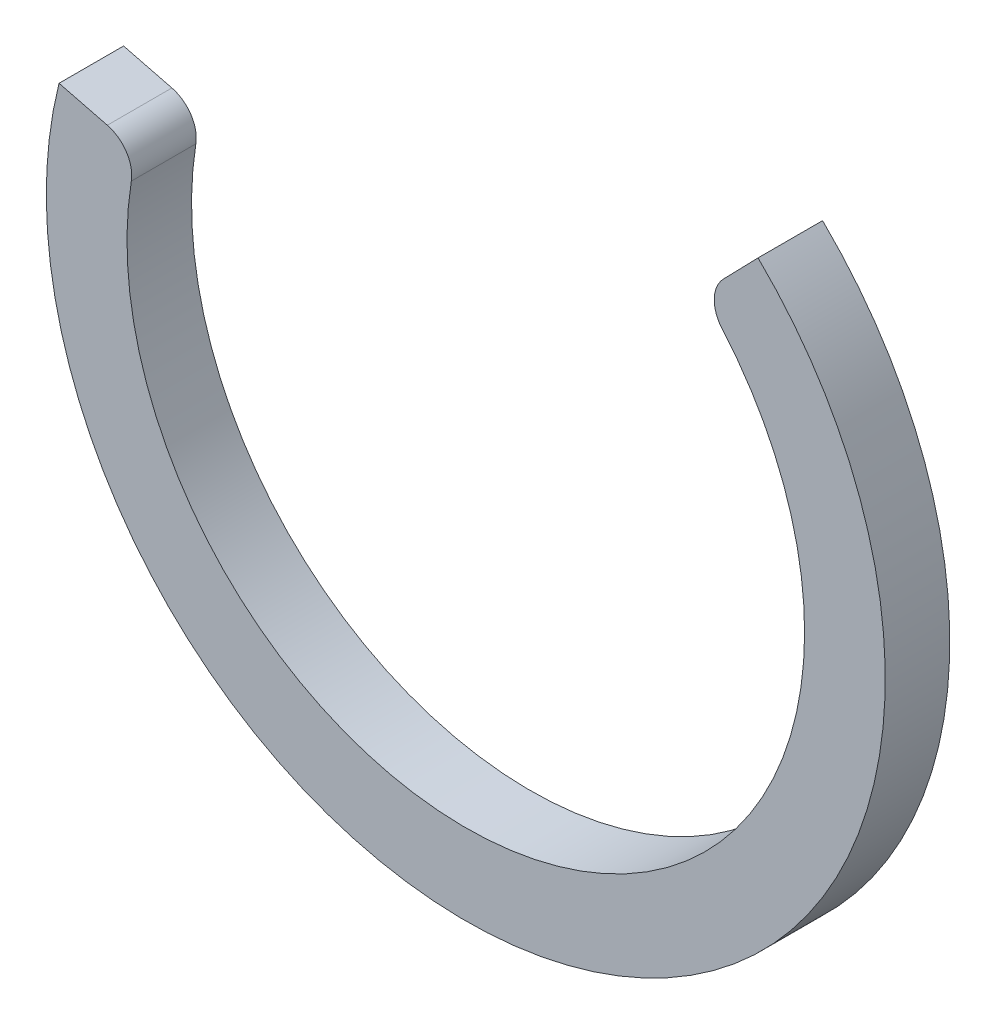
ISO-10303-21;
HEADER;
FILE_DESCRIPTION(('STEP AP214'),'2;1');
FILE_NAME('part.step','',(''),(''),'','','');
FILE_SCHEMA(('AUTOMOTIVE_DESIGN { 1 0 10303 214 1 1 1 1 }'));
ENDSEC;
DATA;
#1=APPLICATION_CONTEXT('core data for automotive mechanical design processes');
#2=APPLICATION_PROTOCOL_DEFINITION('international standard','automotive_design',2000,#1);
#3=PRODUCT_CONTEXT('',#1,'mechanical');
#4=PRODUCT('Part','Part','',(#3));
#5=PRODUCT_RELATED_PRODUCT_CATEGORY('part','',(#4));
#6=PRODUCT_DEFINITION_FORMATION('','',#4);
#7=PRODUCT_DEFINITION_CONTEXT('part definition',#1,'design');
#8=PRODUCT_DEFINITION('design','',#6,#7);
#9=PRODUCT_DEFINITION_SHAPE('','',#8);
#10=(LENGTH_UNIT() NAMED_UNIT(*) SI_UNIT(.MILLI.,.METRE.));
#11=(NAMED_UNIT(*) PLANE_ANGLE_UNIT() SI_UNIT($,.RADIAN.));
#12=(NAMED_UNIT(*) SI_UNIT($,.STERADIAN.) SOLID_ANGLE_UNIT());
#13=UNCERTAINTY_MEASURE_WITH_UNIT(LENGTH_MEASURE(1.E-05),#10,'distance_accuracy_value','');
#14=(GEOMETRIC_REPRESENTATION_CONTEXT(3) GLOBAL_UNCERTAINTY_ASSIGNED_CONTEXT((#13)) GLOBAL_UNIT_ASSIGNED_CONTEXT((#10,
#11,#12)) REPRESENTATION_CONTEXT('',''));
#15=CARTESIAN_POINT('',(0.,0.,0.));
#16=DIRECTION('',(0.,0.,1.));
#17=DIRECTION('',(1.,0.,0.));
#18=AXIS2_PLACEMENT_3D('',#15,#16,#17);
#19=CARTESIAN_POINT('',(0.,0.,10.));
#20=DIRECTION('',(0.,0.,-1.));
#21=DIRECTION('',(-1.,0.,0.));
#22=AXIS2_PLACEMENT_3D('',#19,#20,#21);
#23=CYLINDRICAL_SURFACE('',#22,65.);
#24=CARTESIAN_POINT('',(0.,0.,10.));
#25=DIRECTION('',(0.,0.,1.));
#26=DIRECTION('',(1.,0.,0.));
#27=AXIS2_PLACEMENT_3D('',#24,#25,#26);
#28=CIRCLE('',#27,65.);
#29=CARTESIAN_POINT('',(-63.0241710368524,15.9045234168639,10.));
#30=VERTEX_POINT('',#29);
#31=CARTESIAN_POINT('',(45.285806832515,46.6282714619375,10.));
#32=VERTEX_POINT('',#31);
#33=EDGE_CURVE('E89',#30,#32,#28,.T.);
#34=ORIENTED_EDGE('',*,*,#33,.F.);
#35=DIRECTION('',(0.,0.,-1.));
#36=VECTOR('',#35,1.);
#37=CARTESIAN_POINT('',(-63.0241710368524,15.9045234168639,10.));
#38=LINE('',#37,#36);
#39=CARTESIAN_POINT('',(-63.0241710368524,15.9045234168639,0.));
#40=VERTEX_POINT('',#39);
#41=EDGE_CURVE('E98',#30,#40,#38,.T.);
#42=ORIENTED_EDGE('',*,*,#41,.T.);
#43=CARTESIAN_POINT('',(0.,0.,0.));
#44=DIRECTION('',(0.,0.,1.));
#45=DIRECTION('',(1.,0.,0.));
#46=AXIS2_PLACEMENT_3D('',#43,#44,#45);
#47=CIRCLE('',#46,65.);
#48=CARTESIAN_POINT('',(45.285806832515,46.6282714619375,0.));
#49=VERTEX_POINT('',#48);
#50=EDGE_CURVE('E109',#40,#49,#47,.T.);
#51=ORIENTED_EDGE('',*,*,#50,.T.);
#52=DIRECTION('',(0.,0.,-1.));
#53=VECTOR('',#52,1.);
#54=CARTESIAN_POINT('',(45.285806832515,46.6282714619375,10.));
#55=LINE('',#54,#53);
#56=EDGE_CURVE('E105',#32,#49,#55,.T.);
#57=ORIENTED_EDGE('',*,*,#56,.F.);
#58=EDGE_LOOP('',(#34,#42,#51,#57));
#59=FACE_BOUND('',#58,.T.);
#60=ADVANCED_FACE('F33',(#59),#23,.T.);
#61=CARTESIAN_POINT('',(0.,0.,10.));
#62=DIRECTION('',(0.,0.,1.));
#63=DIRECTION('',(1.,0.,0.));
#64=AXIS2_PLACEMENT_3D('',#61,#62,#63);
#65=PLANE('',#64);
#66=DIRECTION('',(-0.696704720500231,-0.717358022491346,0.));
#67=VECTOR('',#66,1.);
#68=CARTESIAN_POINT('',(45.285806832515,46.6282714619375,10.));
#69=LINE('',#68,#67);
#70=CARTESIAN_POINT('',(39.908776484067,41.0918429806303,10.));
#71=VERTEX_POINT('',#70);
#72=EDGE_CURVE('E94',#32,#71,#69,.T.);
#73=ORIENTED_EDGE('',*,*,#72,.T.);
#74=CARTESIAN_POINT('',(43.4955665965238,37.6083193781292,10.));
#75=DIRECTION('',(0.,0.,1.));
#76=DIRECTION('',(1.,0.,0.));
#77=AXIS2_PLACEMENT_3D('',#74,#75,#76);
#78=CIRCLE('',#77,5.);
#79=CARTESIAN_POINT('',(39.7133434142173,34.3380307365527,10.));
#80=VERTEX_POINT('',#79);
#81=EDGE_CURVE('E11',#71,#80,#78,.T.);
#82=ORIENTED_EDGE('',*,*,#81,.T.);
#83=CARTESIAN_POINT('',(0.,0.,10.));
#84=DIRECTION('',(0.,0.,1.));
#85=DIRECTION('',(1.,0.,0.));
#86=AXIS2_PLACEMENT_3D('',#83,#84,#85);
#87=CIRCLE('',#86,52.5);
#88=CARTESIAN_POINT('',(-51.8283588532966,8.37085530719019,10.));
#89=VERTEX_POINT('',#88);
#90=EDGE_CURVE('E116',#89,#80,#87,.T.);
#91=ORIENTED_EDGE('',*,*,#90,.F.);
#92=CARTESIAN_POINT('',(-56.764393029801,9.16807962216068,10.));
#93=DIRECTION('',(0.,0.,1.));
#94=DIRECTION('',(1.,0.,0.));
#95=AXIS2_PLACEMENT_3D('',#92,#93,#94);
#96=CIRCLE('',#95,5.);
#97=CARTESIAN_POINT('',(-55.5409681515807,14.0160927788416,10.));
#98=VERTEX_POINT('',#97);
#99=EDGE_CURVE('E91',#89,#98,#96,.T.);
#100=ORIENTED_EDGE('',*,*,#99,.T.);
#101=DIRECTION('',(-0.969602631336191,0.24468497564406,0.));
#102=VECTOR('',#101,1.);
#103=CARTESIAN_POINT('',(0.,0.,10.));
#104=LINE('',#103,#102);
#105=EDGE_CURVE('E85',#98,#30,#104,.T.);
#106=ORIENTED_EDGE('',*,*,#105,.T.);
#107=ORIENTED_EDGE('',*,*,#33,.T.);
#108=EDGE_LOOP('',(#73,#82,#91,#100,#106,#107));
#109=FACE_BOUND('',#108,.T.);
#110=ADVANCED_FACE('F87',(#109),#65,.T.);
#111=CARTESIAN_POINT('',(0.,0.,0.));
#112=DIRECTION('',(0.,0.,1.));
#113=DIRECTION('',(1.,0.,0.));
#114=AXIS2_PLACEMENT_3D('',#111,#112,#113);
#115=PLANE('',#114);
#116=CARTESIAN_POINT('',(0.,0.,0.));
#117=DIRECTION('',(0.,0.,1.));
#118=DIRECTION('',(1.,0.,0.));
#119=AXIS2_PLACEMENT_3D('',#116,#117,#118);
#120=CIRCLE('',#119,52.5);
#121=CARTESIAN_POINT('',(-51.8283588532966,8.37085530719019,0.));
#122=VERTEX_POINT('',#121);
#123=CARTESIAN_POINT('',(39.7133434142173,34.3380307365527,0.));
#124=VERTEX_POINT('',#123);
#125=EDGE_CURVE('E113',#122,#124,#120,.T.);
#126=ORIENTED_EDGE('',*,*,#125,.T.);
#127=CARTESIAN_POINT('',(43.4955665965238,37.6083193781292,0.));
#128=DIRECTION('',(0.,0.,1.));
#129=DIRECTION('',(1.,0.,0.));
#130=AXIS2_PLACEMENT_3D('',#127,#128,#129);
#131=CIRCLE('',#130,5.);
#132=CARTESIAN_POINT('',(39.908776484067,41.0918429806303,0.));
#133=VERTEX_POINT('',#132);
#134=EDGE_CURVE('E55',#124,#133,#131,.F.);
#135=ORIENTED_EDGE('',*,*,#134,.T.);
#136=DIRECTION('',(-0.696704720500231,-0.717358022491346,0.));
#137=VECTOR('',#136,1.);
#138=CARTESIAN_POINT('',(45.285806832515,46.6282714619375,0.));
#139=LINE('',#138,#137);
#140=EDGE_CURVE('E95',#49,#133,#139,.T.);
#141=ORIENTED_EDGE('',*,*,#140,.F.);
#142=ORIENTED_EDGE('',*,*,#50,.F.);
#143=DIRECTION('',(-0.969602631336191,0.24468497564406,0.));
#144=VECTOR('',#143,1.);
#145=CARTESIAN_POINT('',(0.,0.,0.));
#146=LINE('',#145,#144);
#147=CARTESIAN_POINT('',(-55.5409681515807,14.0160927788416,0.));
#148=VERTEX_POINT('',#147);
#149=EDGE_CURVE('E101',#148,#40,#146,.T.);
#150=ORIENTED_EDGE('',*,*,#149,.F.);
#151=CARTESIAN_POINT('',(-56.764393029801,9.16807962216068,0.));
#152=DIRECTION('',(0.,0.,1.));
#153=DIRECTION('',(1.,0.,0.));
#154=AXIS2_PLACEMENT_3D('',#151,#152,#153);
#155=CIRCLE('',#154,5.);
#156=EDGE_CURVE('E122',#148,#122,#155,.F.);
#157=ORIENTED_EDGE('',*,*,#156,.T.);
#158=EDGE_LOOP('',(#126,#135,#141,#142,#150,#157));
#159=FACE_BOUND('',#158,.T.);
#160=ADVANCED_FACE('F135',(#159),#115,.F.);
#161=CARTESIAN_POINT('',(0.,0.,0.));
#162=DIRECTION('',(0.,0.,1.));
#163=DIRECTION('',(1.,0.,0.));
#164=AXIS2_PLACEMENT_3D('',#161,#162,#163);
#165=CYLINDRICAL_SURFACE('',#164,52.5);
#166=ORIENTED_EDGE('',*,*,#90,.T.);
#167=DIRECTION('',(0.,0.,1.));
#168=VECTOR('',#167,1.);
#169=CARTESIAN_POINT('',(39.7133434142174,34.3380307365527,0.));
#170=LINE('',#169,#168);
#171=EDGE_CURVE('E124',#80,#124,#170,.F.);
#172=ORIENTED_EDGE('',*,*,#171,.T.);
#173=ORIENTED_EDGE('',*,*,#125,.F.);
#174=DIRECTION('',(0.,0.,1.));
#175=VECTOR('',#174,1.);
#176=CARTESIAN_POINT('',(-51.8283588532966,8.37085530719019,0.));
#177=LINE('',#176,#175);
#178=EDGE_CURVE('E108',#122,#89,#177,.T.);
#179=ORIENTED_EDGE('',*,*,#178,.T.);
#180=EDGE_LOOP('',(#166,#172,#173,#179));
#181=FACE_BOUND('',#180,.T.);
#182=ADVANCED_FACE('F131',(#181),#165,.F.);
#183=CARTESIAN_POINT('',(45.285806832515,46.6282714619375,10.));
#184=DIRECTION('',(0.717358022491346,-0.696704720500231,0.));
#185=DIRECTION('',(0.696704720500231,0.717358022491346,0.));
#186=AXIS2_PLACEMENT_3D('',#183,#184,#185);
#187=PLANE('',#186);
#188=ORIENTED_EDGE('',*,*,#140,.T.);
#189=DIRECTION('',(0.,0.,1.));
#190=VECTOR('',#189,1.);
#191=CARTESIAN_POINT('',(39.908776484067,41.0918429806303,10.));
#192=LINE('',#191,#190);
#193=EDGE_CURVE('E41',#133,#71,#192,.T.);
#194=ORIENTED_EDGE('',*,*,#193,.T.);
#195=ORIENTED_EDGE('',*,*,#72,.F.);
#196=ORIENTED_EDGE('',*,*,#56,.T.);
#197=EDGE_LOOP('',(#188,#194,#195,#196));
#198=FACE_BOUND('',#197,.T.);
#199=ADVANCED_FACE('F158',(#198),#187,.F.);
#200=CARTESIAN_POINT('',(0.,0.,10.));
#201=DIRECTION('',(-0.24468497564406,-0.969602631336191,0.));
#202=DIRECTION('',(0.969602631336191,-0.24468497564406,0.));
#203=AXIS2_PLACEMENT_3D('',#200,#201,#202);
#204=PLANE('',#203);
#205=ORIENTED_EDGE('',*,*,#105,.F.);
#206=DIRECTION('',(0.,0.,1.));
#207=VECTOR('',#206,1.);
#208=CARTESIAN_POINT('',(-55.5409681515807,14.0160927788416,10.));
#209=LINE('',#208,#207);
#210=EDGE_CURVE('E120',#98,#148,#209,.F.);
#211=ORIENTED_EDGE('',*,*,#210,.T.);
#212=ORIENTED_EDGE('',*,*,#149,.T.);
#213=ORIENTED_EDGE('',*,*,#41,.F.);
#214=EDGE_LOOP('',(#205,#211,#212,#213));
#215=FACE_BOUND('',#214,.T.);
#216=ADVANCED_FACE('F99',(#215),#204,.F.);
#217=CARTESIAN_POINT('',(-56.764393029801,9.16807962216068,0.));
#218=DIRECTION('',(0.,0.,1.));
#219=DIRECTION('',(1.,0.,0.));
#220=AXIS2_PLACEMENT_3D('',#217,#218,#219);
#221=CYLINDRICAL_SURFACE('',#220,5.);
#222=ORIENTED_EDGE('',*,*,#156,.F.);
#223=ORIENTED_EDGE('',*,*,#210,.F.);
#224=ORIENTED_EDGE('',*,*,#99,.F.);
#225=ORIENTED_EDGE('',*,*,#178,.F.);
#226=EDGE_LOOP('',(#222,#223,#224,#225));
#227=FACE_BOUND('',#226,.T.);
#228=ADVANCED_FACE('F142',(#227),#221,.T.);
#229=CARTESIAN_POINT('',(43.4955665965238,37.6083193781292,0.));
#230=DIRECTION('',(0.,0.,1.));
#231=DIRECTION('',(1.,0.,0.));
#232=AXIS2_PLACEMENT_3D('',#229,#230,#231);
#233=CYLINDRICAL_SURFACE('',#232,5.);
#234=ORIENTED_EDGE('',*,*,#81,.F.);
#235=ORIENTED_EDGE('',*,*,#193,.F.);
#236=ORIENTED_EDGE('',*,*,#134,.F.);
#237=ORIENTED_EDGE('',*,*,#171,.F.);
#238=EDGE_LOOP('',(#234,#235,#236,#237));
#239=FACE_BOUND('',#238,.T.);
#240=ADVANCED_FACE('F35',(#239),#233,.T.);
#241=CLOSED_SHELL('',(#60,#110,#160,#182,#199,#216,#228,#240));
#242=MANIFOLD_SOLID_BREP('B2',#241);
#243=ADVANCED_BREP_SHAPE_REPRESENTATION('',(#18,#242),#14);
#244=SHAPE_DEFINITION_REPRESENTATION(#9,#243);
ENDSEC;
END-ISO-10303-21;
